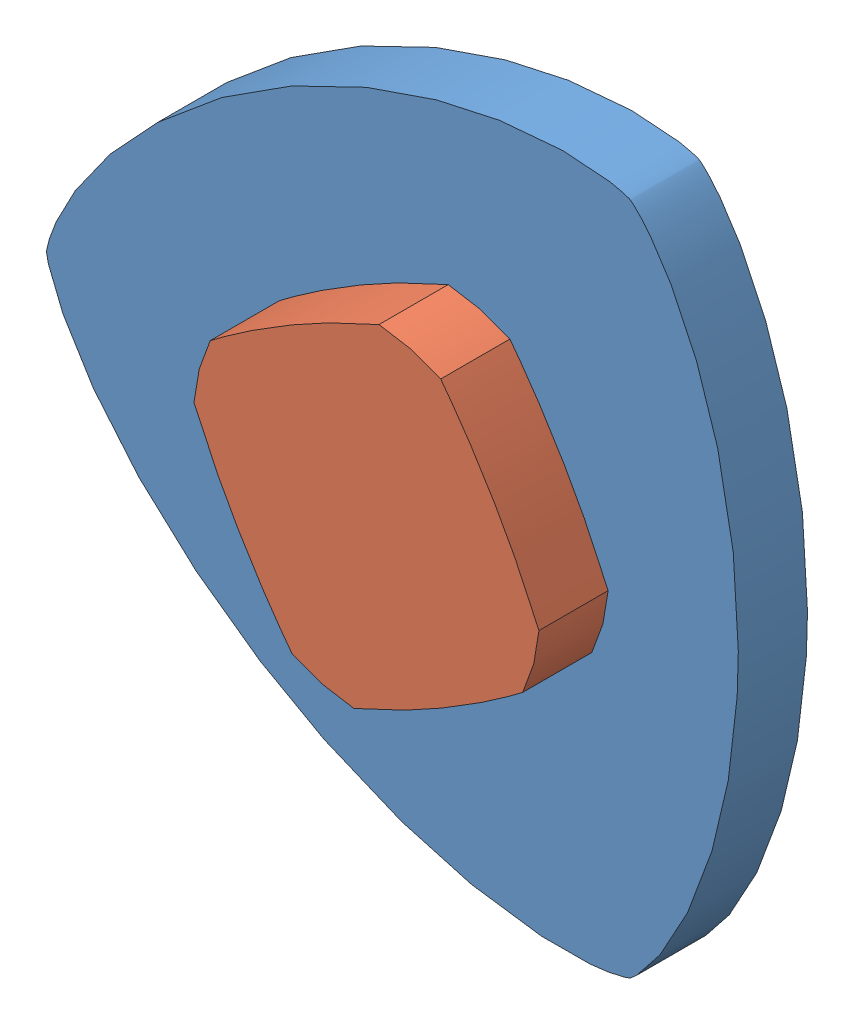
SolidWorks assembly Baugruppe2.SLDASM, configuration Standard (file format 3100). Lengths in mm.
Overall size (100.18 100.17 20).
2 component instances, 2 part files, 0 mates.
Components (placement in the parent):
- Teil1-1: Teil1.sldprt [Standard] at origin size (100.18 100.17 10)
- Teil2-2: Teil2.sldprt [Standard] at (0 0 10) x (0.86415 0.503235 0) z (0 0 1) size (43 43 10)
